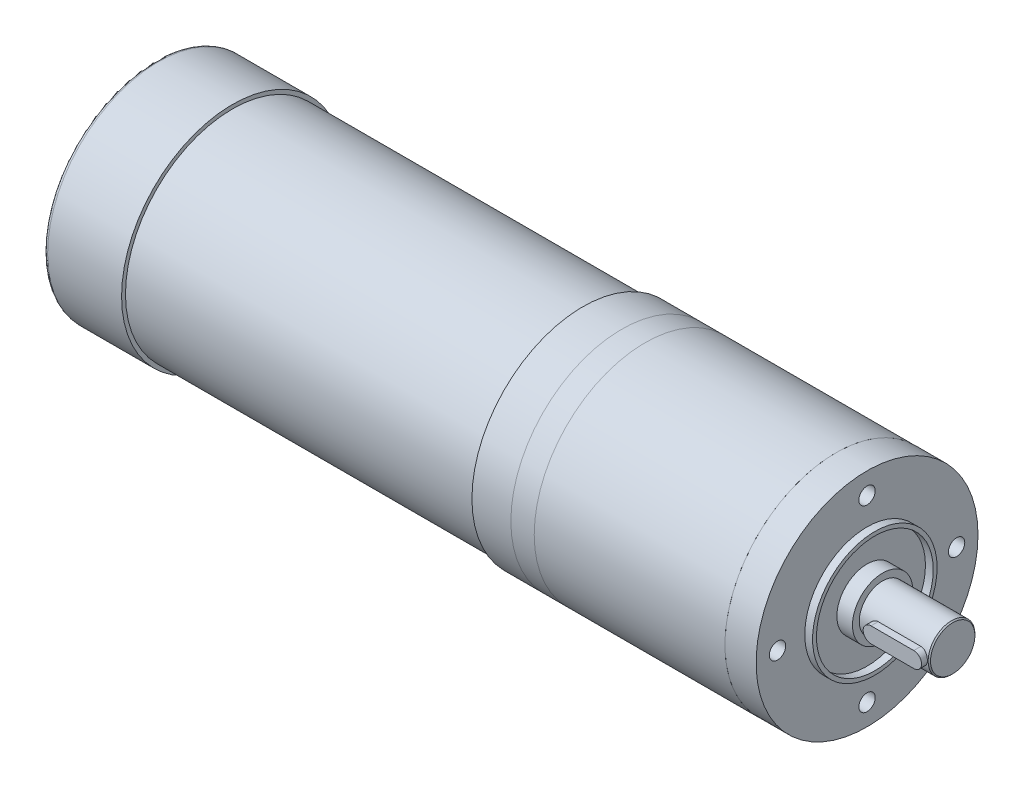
from build123d import *

# Parameters (mm, degrees)
SKETCH_1_R                  = 28.5
EXTRUDE_1_DEPTH             = 8
SKETCH_2_R                  = 28.5
EXTRUDE_2_DEPTH             = 49
SKETCH_3_R                  = 28.5
EXTRUDE_3_DEPTH             = 6
SKETCH_4_R                  = 28.5
EXTRUDE_4_DEPTH             = 10
SKETCH_5_R                  = 27.5
EXTRUDE_5_DEPTH             = 90
SKETCH_6_R                  = 28.5
EXTRUDE_6_DEPTH             = 20
FILLET_1_R                  = 1
SKETCH_7_R                  = 16
SKETCH_7_R_2                = 15
EXTRUDE_7_DEPTH             = 2
SKETCH_8_R                  = 7.75
EXTRUDE_8_DEPTH             = 4
SKETCH_9_R                  = 6
EXTRUDE_9_DEPTH             = 18
HOLE_WIZARD_M5_1_AT_2_COUNT = 2
HOLE_WIZARD_M5_1_AT_2_PITCH = 32.526911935
HOLE_WIZARD_M5_1_AT_3_COUNT = 2
HOLE_WIZARD_M5_1_AT_3_PITCH = 46
HOLE_WIZARD_M5_1_AT_4_COUNT = 2
HOLE_WIZARD_M5_1_AT_4_PITCH = 32.526911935
CUT_EXTRUDE_1_DEPTH         = 2.5
EXTRUDE_10_DEPTH            = 4
CHAMFER_1_SIZE              = 0.3


with BuildPart() as part:
    # Sketch 1 → Extrude 1 (new body)
    with BuildSketch(Plane(origin=(0, 0, 0), x_dir=(0, 0, -1), z_dir=(1, 0, 0))):
        Circle(SKETCH_1_R)
    extrude(amount=-EXTRUDE_1_DEPTH)

    # Sketch 7 → Extrude 7 (add)
    with BuildSketch(Plane(origin=(0, 0, 0), x_dir=(0, 0, -1), z_dir=(1, 0, 0))):
        Circle(SKETCH_7_R)
        Circle(SKETCH_7_R_2, mode=Mode.SUBTRACT)
    extrude(amount=EXTRUDE_7_DEPTH)

    # Sketch 8 → Extrude 8 (add)
    with BuildSketch(Plane(origin=(0, 0, 0), x_dir=(0, 0, -1), z_dir=(1, 0, 0))):
        Circle(SKETCH_8_R)
    extrude(amount=EXTRUDE_8_DEPTH)

    # Sketch 9 → Extrude 9 (add)
    with BuildSketch(Plane(origin=(4, 0, 0), x_dir=(0, 0, -1), z_dir=(1, 0, 0))):
        Circle(SKETCH_9_R)
    extrude(amount=EXTRUDE_9_DEPTH)


with BuildPart() as body_2:
    # Sketch 2 → Extrude 2 (new body)
    with BuildSketch(Plane.ZY.offset(8)):
        Circle(SKETCH_2_R)
    extrude(amount=EXTRUDE_2_DEPTH)


with BuildPart() as body_3:
    # Sketch 3 → Extrude 3 (new body)
    with BuildSketch(Plane.ZY.offset(57)):
        Circle(SKETCH_3_R)
    extrude(amount=EXTRUDE_3_DEPTH)


with BuildPart() as body_4:
    # Sketch 4 → Extrude 4 (new body)
    with BuildSketch(Plane.ZY.offset(63)):
        Circle(SKETCH_4_R)
    extrude(amount=EXTRUDE_4_DEPTH)

    # Sketch 5 → Extrude 5 (add)
    with BuildSketch(Plane.ZY.offset(73)):
        with Locations(Location((0, 0, 0), (0, 0, 180))):
            Circle(SKETCH_5_R)
    extrude(amount=EXTRUDE_5_DEPTH)

    # Sketch 6 → Extrude 6 (add)
    with BuildSketch(Plane.ZY.offset(163)):
        Circle(SKETCH_6_R)
    extrude(amount=EXTRUDE_6_DEPTH)

    # Fillet 1
    fillet_1_edges = [body_4.edges().sort_by_distance(p)[0] for p in [
        (-183, 0, -28.5),
    ]]
    fillet(fillet_1_edges, radius=FILLET_1_R)


with BuildPart() as hole_wizard_m5_1_tool:
    # Sketch 11 → Hole Wizard M5 _1 (revolve)
    with BuildSketch(Plane(origin=(0, 23, 0), x_dir=(0, 0, -1), z_dir=(0, 1, 0))):
        Polygon((0, 0), (0, 15.2618073), (2.1, 14), (2.1, 0), align=None)
    hole_wizard_m5_1 = revolve(axis=Axis((6.35, 23, 0), (-1, 0, 0)))


with BuildPart() as part_1:
    add(part.part)

    # Hole Wizard M5 _1: cut by hole_wizard_m5_1_tool
    add(hole_wizard_m5_1_tool.part, mode=Mode.SUBTRACT)


with BuildPart() as body_2_1:
    add(body_2.part)

    # Hole Wizard M5 _1: cut by hole_wizard_m5_1_tool
    add(hole_wizard_m5_1_tool.part, mode=Mode.SUBTRACT)


with BuildPart() as hole_wizard_m5_1_at_2_tool:
    # Hole Wizard M5 _1 at 2: Hole Wizard M5 _1 ×2
    with Locations(*[Vector(0, -0.7071067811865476, -0.7071067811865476) * (i * HOLE_WIZARD_M5_1_AT_2_PITCH) for i in range(1, HOLE_WIZARD_M5_1_AT_2_COUNT)]):
        add(hole_wizard_m5_1)


with BuildPart() as part_2:
    add(part_1.part)

    # Hole Wizard M5 _1 at 2: cut by hole_wizard_m5_1_at_2_tool
    add(hole_wizard_m5_1_at_2_tool.part, mode=Mode.SUBTRACT)


with BuildPart() as body_2_2:
    add(body_2_1.part)

    # Hole Wizard M5 _1 at 2: cut by hole_wizard_m5_1_at_2_tool
    add(hole_wizard_m5_1_at_2_tool.part, mode=Mode.SUBTRACT)


with BuildPart() as hole_wizard_m5_1_at_3_tool:
    # Hole Wizard M5 _1 at 3: Hole Wizard M5 _1 ×2
    with Locations(*[(0, -i * HOLE_WIZARD_M5_1_AT_3_PITCH, 0) for i in range(1, HOLE_WIZARD_M5_1_AT_3_COUNT)]):
        add(hole_wizard_m5_1)


with BuildPart() as part_3:
    add(part_2.part)

    # Hole Wizard M5 _1 at 3: cut by hole_wizard_m5_1_at_3_tool
    add(hole_wizard_m5_1_at_3_tool.part, mode=Mode.SUBTRACT)


with BuildPart() as body_2_3:
    add(body_2_2.part)

    # Hole Wizard M5 _1 at 3: cut by hole_wizard_m5_1_at_3_tool
    add(hole_wizard_m5_1_at_3_tool.part, mode=Mode.SUBTRACT)


with BuildPart() as hole_wizard_m5_1_at_4_tool:
    # Hole Wizard M5 _1 at 4: Hole Wizard M5 _1 ×2
    with Locations(*[Vector(0, -0.7071067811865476, 0.7071067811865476) * (i * HOLE_WIZARD_M5_1_AT_4_PITCH) for i in range(1, HOLE_WIZARD_M5_1_AT_4_COUNT)]):
        add(hole_wizard_m5_1)


with BuildPart() as part_4:
    add(part_3.part)

    # Hole Wizard M5 _1 at 4: cut by hole_wizard_m5_1_at_4_tool
    add(hole_wizard_m5_1_at_4_tool.part, mode=Mode.SUBTRACT)

    # Sketch 12 → Cut-Extrude 1 (cut)
    with BuildSketch(Plane.XY.offset(6)):
        with BuildLine():
            Line((8.5, 2), (19.5, 2))
            ThreePointArc((19.5, 2), (21.5, 0), (19.5, -2))
            Line((19.5, -2), (8.5, -2))
            ThreePointArc((8.5, -2), (6.5, 0), (8.5, 2))
        make_face()
    extrude(amount=-CUT_EXTRUDE_1_DEPTH, mode=Mode.SUBTRACT)

    # Chamfer 1
    chamfer_1_edges = [part_4.edges().sort_by_distance(p)[0] for p in [
        (22, 0, 6),
    ]]
    chamfer(chamfer_1_edges, length=CHAMFER_1_SIZE)


with BuildPart() as body_2_4:
    add(body_2_3.part)

    # Hole Wizard M5 _1 at 4: cut by hole_wizard_m5_1_at_4_tool
    add(hole_wizard_m5_1_at_4_tool.part, mode=Mode.SUBTRACT)


with BuildPart() as body_5:
    # Sketch 13 → Extrude 10 (new body)
    with BuildSketch(Plane.XY.offset(3.5)):
        with BuildLine():
            Line((8.5, 2), (19.5, 2))
            ThreePointArc((19.5, 2), (21.5, 0), (19.5, -2))
            Line((19.5, -2), (8.5, -2))
            ThreePointArc((8.5, -2), (6.5, 0), (8.5, 2))
        make_face()
    extrude(amount=EXTRUDE_10_DEPTH)


solid = Compound([body_3.part, body_4.part, part_4.part, body_2_4.part, body_5.part])
